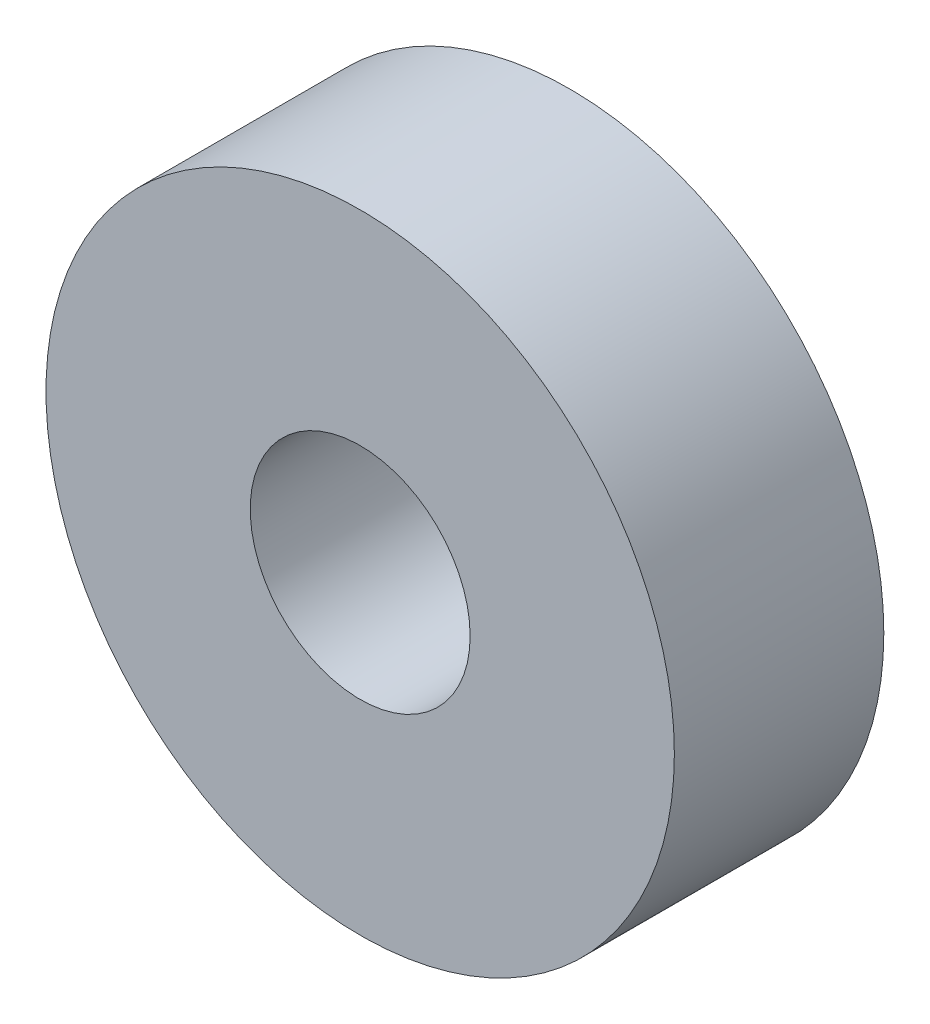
ISO-10303-21;
HEADER;
FILE_DESCRIPTION(('STEP AP214'),'2;1');
FILE_NAME('part.step','',(''),(''),'','','');
FILE_SCHEMA(('AUTOMOTIVE_DESIGN { 1 0 10303 214 1 1 1 1 }'));
ENDSEC;
DATA;
#1=APPLICATION_CONTEXT('core data for automotive mechanical design processes');
#2=APPLICATION_PROTOCOL_DEFINITION('international standard','automotive_design',2000,#1);
#3=PRODUCT_CONTEXT('',#1,'mechanical');
#4=PRODUCT('Part','Part','',(#3));
#5=PRODUCT_RELATED_PRODUCT_CATEGORY('part','',(#4));
#6=PRODUCT_DEFINITION_FORMATION('','',#4);
#7=PRODUCT_DEFINITION_CONTEXT('part definition',#1,'design');
#8=PRODUCT_DEFINITION('design','',#6,#7);
#9=PRODUCT_DEFINITION_SHAPE('','',#8);
#10=(LENGTH_UNIT() NAMED_UNIT(*) SI_UNIT(.MILLI.,.METRE.));
#11=(NAMED_UNIT(*) PLANE_ANGLE_UNIT() SI_UNIT($,.RADIAN.));
#12=(NAMED_UNIT(*) SI_UNIT($,.STERADIAN.) SOLID_ANGLE_UNIT());
#13=UNCERTAINTY_MEASURE_WITH_UNIT(LENGTH_MEASURE(1.E-05),#10,'distance_accuracy_value','');
#14=(GEOMETRIC_REPRESENTATION_CONTEXT(3) GLOBAL_UNCERTAINTY_ASSIGNED_CONTEXT((#13)) GLOBAL_UNIT_ASSIGNED_CONTEXT((#10,
#11,#12)) REPRESENTATION_CONTEXT('',''));
#15=CARTESIAN_POINT('',(0.,0.,0.));
#16=DIRECTION('',(0.,0.,1.));
#17=DIRECTION('',(1.,0.,0.));
#18=AXIS2_PLACEMENT_3D('',#15,#16,#17);
#19=CARTESIAN_POINT('',(0.,0.,10.));
#20=DIRECTION('',(0.,0.,1.));
#21=DIRECTION('',(1.,0.,0.));
#22=AXIS2_PLACEMENT_3D('',#19,#20,#21);
#23=PLANE('',#22);
#24=CARTESIAN_POINT('',(0.,0.,10.));
#25=DIRECTION('',(0.,0.,1.));
#26=DIRECTION('',(1.,0.,0.));
#27=AXIS2_PLACEMENT_3D('',#24,#25,#26);
#28=CIRCLE('',#27,15.);
#29=CARTESIAN_POINT('',(15.,0.,10.));
#30=VERTEX_POINT('',#29);
#31=EDGE_CURVE('E8',#30,#30,#28,.T.);
#32=ORIENTED_EDGE('',*,*,#31,.T.);
#33=EDGE_LOOP('',(#32));
#34=FACE_BOUND('',#33,.T.);
#35=CARTESIAN_POINT('',(0.,0.,10.));
#36=DIRECTION('',(0.,0.,1.));
#37=DIRECTION('',(1.,0.,0.));
#38=AXIS2_PLACEMENT_3D('',#35,#36,#37);
#39=CIRCLE('',#38,5.25);
#40=CARTESIAN_POINT('',(5.25,0.,10.));
#41=VERTEX_POINT('',#40);
#42=EDGE_CURVE('E23',#41,#41,#39,.T.);
#43=ORIENTED_EDGE('',*,*,#42,.F.);
#44=EDGE_LOOP('',(#43));
#45=FACE_BOUND('',#44,.T.);
#46=ADVANCED_FACE('F12',(#34,#45),#23,.T.);
#47=CARTESIAN_POINT('',(0.,0.,0.));
#48=DIRECTION('',(0.,0.,1.));
#49=DIRECTION('',(1.,0.,0.));
#50=AXIS2_PLACEMENT_3D('',#47,#48,#49);
#51=PLANE('',#50);
#52=CARTESIAN_POINT('',(0.,0.,0.));
#53=DIRECTION('',(0.,0.,1.));
#54=DIRECTION('',(1.,0.,0.));
#55=AXIS2_PLACEMENT_3D('',#52,#53,#54);
#56=CIRCLE('',#55,15.);
#57=CARTESIAN_POINT('',(15.,0.,0.));
#58=VERTEX_POINT('',#57);
#59=EDGE_CURVE('E19',#58,#58,#56,.T.);
#60=ORIENTED_EDGE('',*,*,#59,.F.);
#61=EDGE_LOOP('',(#60));
#62=FACE_BOUND('',#61,.T.);
#63=CARTESIAN_POINT('',(0.,0.,0.));
#64=DIRECTION('',(0.,0.,1.));
#65=DIRECTION('',(1.,0.,0.));
#66=AXIS2_PLACEMENT_3D('',#63,#64,#65);
#67=CIRCLE('',#66,5.25);
#68=CARTESIAN_POINT('',(5.25,0.,0.));
#69=VERTEX_POINT('',#68);
#70=EDGE_CURVE('E27',#69,#69,#67,.T.);
#71=ORIENTED_EDGE('',*,*,#70,.T.);
#72=EDGE_LOOP('',(#71));
#73=FACE_BOUND('',#72,.T.);
#74=ADVANCED_FACE('F33',(#62,#73),#51,.F.);
#75=CARTESIAN_POINT('',(0.,0.,10.));
#76=DIRECTION('',(0.,0.,-1.));
#77=DIRECTION('',(-1.,0.,0.));
#78=AXIS2_PLACEMENT_3D('',#75,#76,#77);
#79=CYLINDRICAL_SURFACE('',#78,15.);
#80=ORIENTED_EDGE('',*,*,#31,.F.);
#81=EDGE_LOOP('',(#80));
#82=FACE_BOUND('',#81,.T.);
#83=ORIENTED_EDGE('',*,*,#59,.T.);
#84=EDGE_LOOP('',(#83));
#85=FACE_BOUND('',#84,.T.);
#86=ADVANCED_FACE('F14',(#82,#85),#79,.T.);
#87=CARTESIAN_POINT('',(0.,0.,10.));
#88=DIRECTION('',(0.,0.,-1.));
#89=DIRECTION('',(-1.,0.,0.));
#90=AXIS2_PLACEMENT_3D('',#87,#88,#89);
#91=CYLINDRICAL_SURFACE('',#90,5.25);
#92=ORIENTED_EDGE('',*,*,#42,.T.);
#93=EDGE_LOOP('',(#92));
#94=FACE_BOUND('',#93,.T.);
#95=ORIENTED_EDGE('',*,*,#70,.F.);
#96=EDGE_LOOP('',(#95));
#97=FACE_BOUND('',#96,.T.);
#98=ADVANCED_FACE('F35',(#94,#97),#91,.F.);
#99=CLOSED_SHELL('',(#46,#74,#86,#98));
#100=MANIFOLD_SOLID_BREP('B1',#99);
#101=ADVANCED_BREP_SHAPE_REPRESENTATION('',(#18,#100),#14);
#102=SHAPE_DEFINITION_REPRESENTATION(#9,#101);
ENDSEC;
END-ISO-10303-21;
